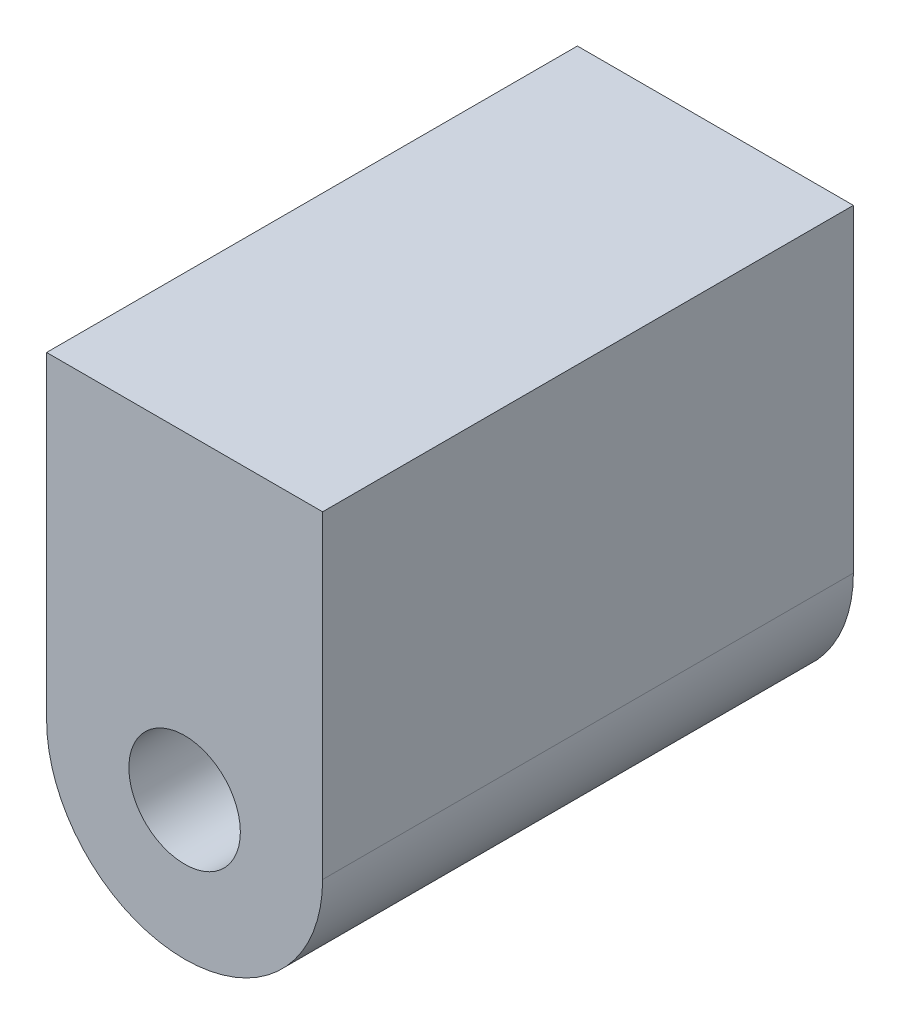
from build123d import *

# Parameters (mm, degrees)
ESQUISSE1_R        = 5.25
BOSS_EXTRU_1_DEPTH = 50


with BuildPart() as part:
    # Esquisse1 → Boss.-Extru.1 (new body)
    with BuildSketch(Plane.XY):
        with BuildLine():
            Line((-13, 0), (-13, 30))
            Line((-13, 30), (13, 30))
            Line((13, 30), (13, 0))
            ThreePointArc((13, 0), (0, -13), (-13, 0))
        make_face()
        Circle(ESQUISSE1_R, mode=Mode.SUBTRACT)
    extrude(amount=BOSS_EXTRU_1_DEPTH)


solid = part.part
